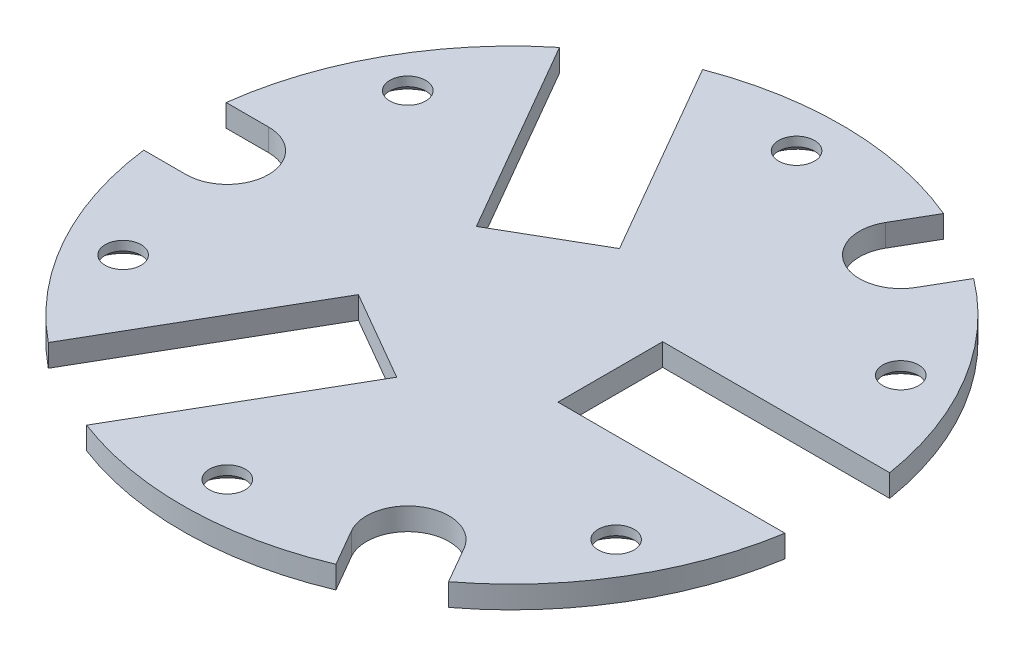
from build123d import *

# Parameters (mm, degrees)
SKETCH1_R                                 = 34.925
EXTRUDE1_DEPTH                            = 1.1811
CUT_EXTRUDE1_DEPTH                        = 50.447863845
CIRPATTERN4_COUNT                         = 3
CUT_EXTRUDE2_REACH                        = 51.448
CIRPATTERN5_COUNT                         = 3
CSK_FOR_6_FLAT_HEAD_MACHINE_SCREW_2_COUNT = 2
CSK_FOR_6_FLAT_HEAD_MACHINE_SCREW_2_PITCH = 30.162495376
CSK_FOR_6_FLAT_HEAD_MACHINE_SCREW_3_COUNT = 2
CSK_FOR_6_FLAT_HEAD_MACHINE_SCREW_3_PITCH = 52.242979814
CSK_FOR_6_FLAT_HEAD_MACHINE_SCREW_4_COUNT = 2
CSK_FOR_6_FLAT_HEAD_MACHINE_SCREW_4_PITCH = 60.325
CSK_FOR_6_FLAT_HEAD_MACHINE_SCREW_5_COUNT = 2
CSK_FOR_6_FLAT_HEAD_MACHINE_SCREW_5_PITCH = 52.242979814
CSK_FOR_6_FLAT_HEAD_MACHINE_SCREW_6_COUNT = 2
CSK_FOR_6_FLAT_HEAD_MACHINE_SCREW_6_PITCH = 30.162495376


with BuildPart() as part:
    # Sketch1 → Extrude1 (new, symmetric)
    with BuildSketch(Plane(origin=(0, 0, 0), x_dir=(1, 0, 0), z_dir=(0, 1, 0))):
        with Locations(Location((0, 0, 0), (0, 0, 270))):
            Circle(SKETCH1_R)
    extrude(amount=EXTRUDE1_DEPTH, both=True)

    # Sketch2 → Cut-Extrude1 (cut, through all)
    with BuildSketch(Plane(origin=(0, 1.1811, 0), x_dir=(-1, 0, 0), z_dir=(0, 1, 0))):
        with BuildLine():
            Line((-34.481215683, -5.5499), (-10.4267, -5.5499))
            Line((-10.4267, -5.5499), (-10.4267, 5.5499))
            Line((-10.4267, 5.5499), (-34.481215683, 5.5499))
            ThreePointArc((-34.481215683, 5.5499), (-34.925, 0), (-34.481215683, -5.5499))
        make_face()
    cut_extrude1 = extrude(amount=-CUT_EXTRUDE1_DEPTH, mode=Mode.SUBTRACT)

    # CirPattern4: Cut-Extrude1 ×3 about axis
    cirpattern4_axis = Axis((0, 1.1811, 0), (0, -1, 0))
    for i in range(1, CIRPATTERN4_COUNT):
        add(cut_extrude1.rotate(cirpattern4_axis, i * 360 / CIRPATTERN4_COUNT), mode=Mode.SUBTRACT)

    # Sketch3 → Cut-Extrude2 (cut, up to next)
    with BuildSketch(Plane(origin=(0, 1.1811, 0), x_dir=(1, 0, 0), z_dir=(0, 1, 0)), mode=Mode.PRIVATE) as cut_extrude2_sk1:
        with BuildLine():
            Line((-34.650674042, 4.3688), (-30.1625, 4.3688))
            ThreePointArc((-30.1625, 4.3688), (-25.7937, 0), (-30.1625, -4.3688))
            Line((-30.1625, -4.3688), (-34.650674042, -4.3688))
            ThreePointArc((-34.650674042, -4.3688), (-34.925, 0), (-34.650674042, 4.3688))
        make_face()
    cut_extrude2_tool1 = extrude(cut_extrude2_sk1.sketch, amount=-CUT_EXTRUDE2_REACH, mode=Mode.PRIVATE) & part.part
    cut_extrude2 = cut_extrude2_tool1.solids().sort_by_distance((-30.724215, 1.1811, 0))[0]
    add(cut_extrude2, mode=Mode.SUBTRACT)

    # CirPattern5: Cut-Extrude2 ×3 about axis
    cirpattern5_axis = Axis((0, 0, 0), (0, 1, 0))
    for i in range(1, CIRPATTERN5_COUNT):
        add(cut_extrude2.rotate(cirpattern5_axis, i * 360 / CIRPATTERN5_COUNT), mode=Mode.SUBTRACT)

    # Sketch6 → CSK for _6 Flat Head Machine Screw _100 (revolve, cut)
    with BuildSketch(Plane(origin=(0, -1.1811, 30.1625), x_dir=(0, 0, -1), z_dir=(1, 0, 0))):
        Polygon((0, 0), (0, 2.3622), (1.89865, 2.3622), (1.89865, 1.380025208), (3.5433, 0), align=None)
    csk_for_6_flat_head_machine_screw_100 = revolve(axis=Axis((0, -7.5311, 30.1625), (0, 1, 0)), mode=Mode.SUBTRACT)

    # CSK for _6 Flat Head Machine Screw _ 2: CSK for _6 Flat Head Machine Screw _100 ×2
    with Locations(*[Vector(-0.8660253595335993, 0, -0.500000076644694) * (i * CSK_FOR_6_FLAT_HEAD_MACHINE_SCREW_2_PITCH) for i in range(1, CSK_FOR_6_FLAT_HEAD_MACHINE_SCREW_2_COUNT)]):
        add(csk_for_6_flat_head_machine_screw_100, mode=Mode.SUBTRACT)

    # CSK for _6 Flat Head Machine Screw _ 3: CSK for _6 Flat Head Machine Screw _100 ×2
    with Locations(*[Vector(-0.49999992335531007, 0, -0.8660254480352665) * (i * CSK_FOR_6_FLAT_HEAD_MACHINE_SCREW_3_PITCH) for i in range(1, CSK_FOR_6_FLAT_HEAD_MACHINE_SCREW_3_COUNT)]):
        add(csk_for_6_flat_head_machine_screw_100, mode=Mode.SUBTRACT)

    # CSK for _6 Flat Head Machine Screw _ 4: CSK for _6 Flat Head Machine Screw _100 ×2
    with Locations(*[(0, 0, -i * CSK_FOR_6_FLAT_HEAD_MACHINE_SCREW_4_PITCH) for i in range(1, CSK_FOR_6_FLAT_HEAD_MACHINE_SCREW_4_COUNT)]):
        add(csk_for_6_flat_head_machine_screw_100, mode=Mode.SUBTRACT)

    # CSK for _6 Flat Head Machine Screw _ 5: CSK for _6 Flat Head Machine Screw _100 ×2
    with Locations(*[Vector(0.4999999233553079, 0, -0.8660254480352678) * (i * CSK_FOR_6_FLAT_HEAD_MACHINE_SCREW_5_PITCH) for i in range(1, CSK_FOR_6_FLAT_HEAD_MACHINE_SCREW_5_COUNT)]):
        add(csk_for_6_flat_head_machine_screw_100, mode=Mode.SUBTRACT)

    # CSK for _6 Flat Head Machine Screw _ 6: CSK for _6 Flat Head Machine Screw _100 ×2
    with Locations(*[Vector(0.8660253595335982, 0, -0.5000000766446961) * (i * CSK_FOR_6_FLAT_HEAD_MACHINE_SCREW_6_PITCH) for i in range(1, CSK_FOR_6_FLAT_HEAD_MACHINE_SCREW_6_COUNT)]):
        add(csk_for_6_flat_head_machine_screw_100, mode=Mode.SUBTRACT)


solid = part.part
